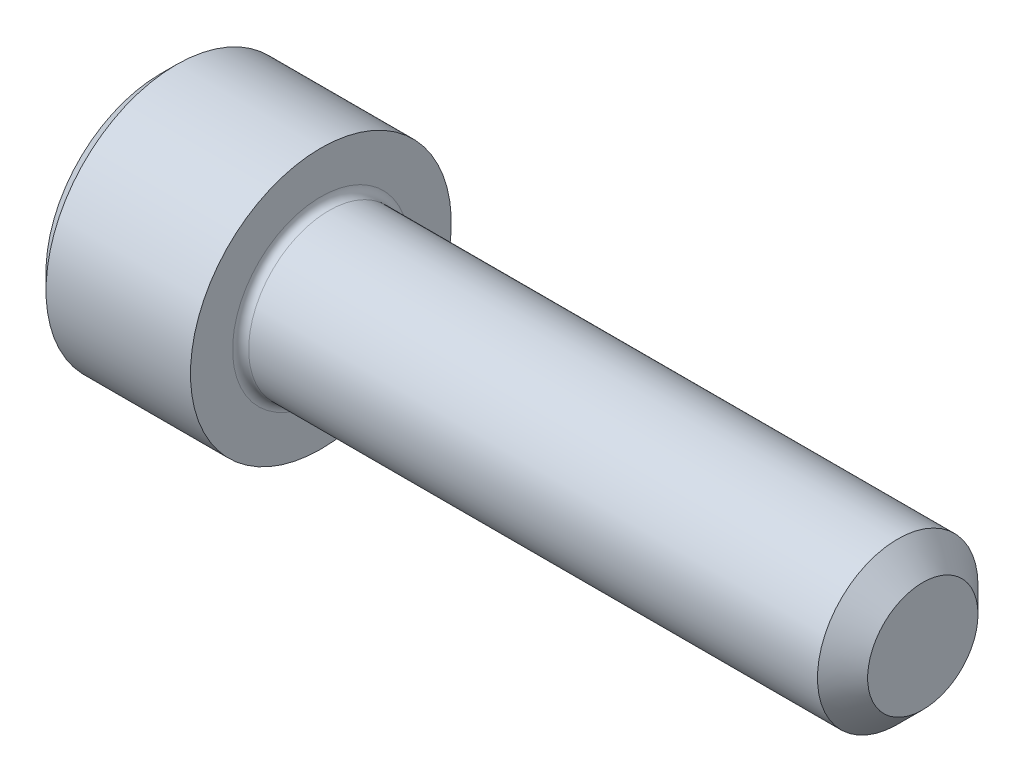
ISO-10303-21;
HEADER;
FILE_DESCRIPTION(('STEP AP214'),'2;1');
FILE_NAME('part.step','',(''),(''),'','','');
FILE_SCHEMA(('AUTOMOTIVE_DESIGN { 1 0 10303 214 1 1 1 1 }'));
ENDSEC;
DATA;
#1=APPLICATION_CONTEXT('core data for automotive mechanical design processes');
#2=APPLICATION_PROTOCOL_DEFINITION('international standard','automotive_design',2000,#1);
#3=PRODUCT_CONTEXT('',#1,'mechanical');
#4=PRODUCT('Part','Part','',(#3));
#5=PRODUCT_RELATED_PRODUCT_CATEGORY('part','',(#4));
#6=PRODUCT_DEFINITION_FORMATION('','',#4);
#7=PRODUCT_DEFINITION_CONTEXT('part definition',#1,'design');
#8=PRODUCT_DEFINITION('design','',#6,#7);
#9=PRODUCT_DEFINITION_SHAPE('','',#8);
#10=(LENGTH_UNIT() NAMED_UNIT(*) SI_UNIT(.MILLI.,.METRE.));
#11=(NAMED_UNIT(*) PLANE_ANGLE_UNIT() SI_UNIT($,.RADIAN.));
#12=(NAMED_UNIT(*) SI_UNIT($,.STERADIAN.) SOLID_ANGLE_UNIT());
#13=UNCERTAINTY_MEASURE_WITH_UNIT(LENGTH_MEASURE(1.E-05),#10,'distance_accuracy_value','');
#14=(GEOMETRIC_REPRESENTATION_CONTEXT(3) GLOBAL_UNCERTAINTY_ASSIGNED_CONTEXT((#13)) GLOBAL_UNIT_ASSIGNED_CONTEXT((#10,
#11,#12)) REPRESENTATION_CONTEXT('',''));
#15=CARTESIAN_POINT('',(0.,0.,0.));
#16=DIRECTION('',(0.,0.,1.));
#17=DIRECTION('',(1.,0.,0.));
#18=AXIS2_PLACEMENT_3D('',#15,#16,#17);
#19=CARTESIAN_POINT('',(27.655035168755,0.837738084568,-0.498957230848));
#20=DIRECTION('',(-1.,0.,0.));
#21=DIRECTION('',(0.,0.,-1.));
#22=AXIS2_PLACEMENT_3D('',#19,#20,#21);
#23=CONICAL_SURFACE('',#22,3.375,0.785398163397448);
#24=CARTESIAN_POINT('',(28.280035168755,0.837738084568,-0.498957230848));
#25=DIRECTION('',(-1.,0.,0.));
#26=DIRECTION('',(0.,0.,-1.));
#27=AXIS2_PLACEMENT_3D('',#24,#25,#26);
#28=CIRCLE('',#27,2.75);
#29=CARTESIAN_POINT('',(28.280035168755,0.837738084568,-3.248957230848));
#30=VERTEX_POINT('',#29);
#31=EDGE_CURVE('E10',#30,#30,#28,.T.);
#32=ORIENTED_EDGE('',*,*,#31,.T.);
#33=EDGE_LOOP('',(#32));
#34=FACE_BOUND('',#33,.T.);
#35=CARTESIAN_POINT('',(27.030035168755,0.837738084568,-0.498957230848));
#36=DIRECTION('',(-1.,0.,0.));
#37=DIRECTION('',(0.,0.,-1.));
#38=AXIS2_PLACEMENT_3D('',#35,#36,#37);
#39=CIRCLE('',#38,4.);
#40=CARTESIAN_POINT('',(27.030035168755,0.837738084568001,-4.498957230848));
#41=VERTEX_POINT('',#40);
#42=EDGE_CURVE('E25',#41,#41,#39,.T.);
#43=ORIENTED_EDGE('',*,*,#42,.F.);
#44=EDGE_LOOP('',(#43));
#45=FACE_BOUND('',#44,.T.);
#46=ADVANCED_FACE('F16',(#34,#45),#23,.T.);
#47=CARTESIAN_POINT('',(28.280035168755,0.837738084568,-0.498957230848));
#48=DIRECTION('',(-1.,0.,0.));
#49=DIRECTION('',(0.,0.,1.));
#50=AXIS2_PLACEMENT_3D('',#47,#48,#49);
#51=PLANE('',#50);
#52=ORIENTED_EDGE('',*,*,#31,.F.);
#53=EDGE_LOOP('',(#52));
#54=FACE_BOUND('',#53,.T.);
#55=ADVANCED_FACE('F428',(#54),#51,.F.);
#56=CARTESIAN_POINT('',(28.280035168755,0.837738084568,-0.498957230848));
#57=DIRECTION('',(-1.,0.,0.));
#58=DIRECTION('',(0.,0.,-1.));
#59=AXIS2_PLACEMENT_3D('',#56,#57,#58);
#60=CYLINDRICAL_SURFACE('',#59,4.);
#61=ORIENTED_EDGE('',*,*,#42,.T.);
#62=EDGE_LOOP('',(#61));
#63=FACE_BOUND('',#62,.T.);
#64=CARTESIAN_POINT('',(-1.319964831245,0.837738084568,-0.498957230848));
#65=DIRECTION('',(-1.,0.,0.));
#66=DIRECTION('',(0.,0.,-1.));
#67=AXIS2_PLACEMENT_3D('',#64,#65,#66);
#68=CIRCLE('',#67,4.);
#69=CARTESIAN_POINT('',(-1.319964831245,0.837738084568,-4.498957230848));
#70=VERTEX_POINT('',#69);
#71=EDGE_CURVE('E230',#70,#70,#68,.T.);
#72=ORIENTED_EDGE('',*,*,#71,.F.);
#73=EDGE_LOOP('',(#72));
#74=FACE_BOUND('',#73,.T.);
#75=ADVANCED_FACE('F432',(#63,#74),#60,.T.);
#76=CARTESIAN_POINT('',(-1.319964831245,0.837738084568,-0.498957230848));
#77=DIRECTION('',(-1.,0.,0.));
#78=DIRECTION('',(0.,0.,-1.));
#79=AXIS2_PLACEMENT_3D('',#76,#77,#78);
#80=TOROIDAL_SURFACE('',#79,4.4,0.4);
#81=ORIENTED_EDGE('',*,*,#71,.T.);
#82=EDGE_LOOP('',(#81));
#83=FACE_BOUND('',#82,.T.);
#84=CARTESIAN_POINT('',(-1.719964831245,0.837738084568,-0.498957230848));
#85=DIRECTION('',(-1.,0.,0.));
#86=DIRECTION('',(0.,0.,-1.));
#87=AXIS2_PLACEMENT_3D('',#84,#85,#86);
#88=CIRCLE('',#87,4.4);
#89=CARTESIAN_POINT('',(-1.719964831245,0.837738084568,-4.898957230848));
#90=VERTEX_POINT('',#89);
#91=EDGE_CURVE('E209',#90,#90,#88,.T.);
#92=ORIENTED_EDGE('',*,*,#91,.F.);
#93=EDGE_LOOP('',(#92));
#94=FACE_BOUND('',#93,.T.);
#95=ADVANCED_FACE('F440',(#83,#94),#80,.F.);
#96=CARTESIAN_POINT('',(-3.85393942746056,0.837738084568,-0.498957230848));
#97=DIRECTION('',(-1.,0.,0.));
#98=DIRECTION('',(0.,-1.,0.));
#99=AXIS2_PLACEMENT_3D('',#96,#97,#98);
#100=CONICAL_SURFACE('',#99,1.5,1.0471975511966);
#101=CARTESIAN_POINT('',(-2.98791402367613,0.837738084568,-0.498957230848));
#102=VERTEX_POINT('',#101);
#103=VERTEX_LOOP('',#102);
#104=FACE_BOUND('',#103,.T.);
#105=CARTESIAN_POINT('',(-4.719964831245,0.837738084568,-0.498957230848));
#106=DIRECTION('',(1.,0.,0.));
#107=DIRECTION('',(0.,1.,0.));
#108=AXIS2_PLACEMENT_3D('',#105,#106,#107);
#109=CIRCLE('',#108,3.);
#110=CARTESIAN_POINT('',(-4.719964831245,3.837738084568,-0.498957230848));
#111=VERTEX_POINT('',#110);
#112=EDGE_CURVE('E206',#111,#111,#109,.T.);
#113=ORIENTED_EDGE('',*,*,#112,.F.);
#114=EDGE_LOOP('',(#113));
#115=FACE_BOUND('',#114,.T.);
#116=ADVANCED_FACE('F446',(#104,#115),#100,.F.);
#117=CARTESIAN_POINT('',(-1.719964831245,0.837738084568,-0.498957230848));
#118=DIRECTION('',(1.,0.,0.));
#119=DIRECTION('',(0.,1.,0.));
#120=AXIS2_PLACEMENT_3D('',#117,#118,#119);
#121=PLANE('',#120);
#122=ORIENTED_EDGE('',*,*,#91,.T.);
#123=EDGE_LOOP('',(#122));
#124=FACE_BOUND('',#123,.T.);
#125=CARTESIAN_POINT('',(-1.719964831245,0.837738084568,-0.498957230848));
#126=DIRECTION('',(1.,0.,0.));
#127=DIRECTION('',(0.,1.,0.));
#128=AXIS2_PLACEMENT_3D('',#125,#126,#127);
#129=CIRCLE('',#128,6.5);
#130=CARTESIAN_POINT('',(-1.719964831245,7.337738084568,-0.498957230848));
#131=VERTEX_POINT('',#130);
#132=EDGE_CURVE('E210',#131,#131,#129,.T.);
#133=ORIENTED_EDGE('',*,*,#132,.T.);
#134=EDGE_LOOP('',(#133));
#135=FACE_BOUND('',#134,.T.);
#136=ADVANCED_FACE('F450',(#124,#135),#121,.T.);
#137=CARTESIAN_POINT('',(-9.719964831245,0.837738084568,-0.498957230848));
#138=DIRECTION('',(1.,0.,0.));
#139=DIRECTION('',(0.,1.,0.));
#140=AXIS2_PLACEMENT_3D('',#137,#138,#139);
#141=CYLINDRICAL_SURFACE('',#140,3.);
#142=CARTESIAN_POINT('',(-5.719964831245,0.837738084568,-0.498957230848));
#143=DIRECTION('',(1.,0.,0.));
#144=DIRECTION('',(0.,0.866025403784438,-0.5));
#145=AXIS2_PLACEMENT_3D('',#142,#143,#144);
#146=CIRCLE('',#145,3.);
#147=CARTESIAN_POINT('',(-5.719964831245,3.43581429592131,-1.998957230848));
#148=VERTEX_POINT('',#147);
#149=CARTESIAN_POINT('',(-5.719964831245,3.837738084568,-0.498957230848));
#150=VERTEX_POINT('',#149);
#151=EDGE_CURVE('E247',#148,#150,#146,.T.);
#152=ORIENTED_EDGE('',*,*,#151,.F.);
#153=CARTESIAN_POINT('',(-5.719964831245,0.837738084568,-0.498957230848));
#154=DIRECTION('',(1.,0.,0.));
#155=DIRECTION('',(0.,0.,-1.));
#156=AXIS2_PLACEMENT_3D('',#153,#154,#155);
#157=CIRCLE('',#156,3.);
#158=CARTESIAN_POINT('',(-5.719964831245,0.837738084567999,-3.498957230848));
#159=VERTEX_POINT('',#158);
#160=EDGE_CURVE('E159',#159,#148,#157,.T.);
#161=ORIENTED_EDGE('',*,*,#160,.F.);
#162=CARTESIAN_POINT('',(-5.719964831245,0.837738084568,-0.498957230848));
#163=DIRECTION('',(1.,0.,0.));
#164=DIRECTION('',(0.,-0.866025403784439,-0.5));
#165=AXIS2_PLACEMENT_3D('',#162,#163,#164);
#166=CIRCLE('',#165,3.);
#167=CARTESIAN_POINT('',(-5.719964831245,-1.76033812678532,-1.998957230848));
#168=VERTEX_POINT('',#167);
#169=EDGE_CURVE('E154',#168,#159,#166,.T.);
#170=ORIENTED_EDGE('',*,*,#169,.F.);
#171=CARTESIAN_POINT('',(-5.719964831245,0.837738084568,-0.498957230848));
#172=DIRECTION('',(1.,0.,0.));
#173=DIRECTION('',(0.,-0.866025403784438,0.5));
#174=AXIS2_PLACEMENT_3D('',#171,#172,#173);
#175=CIRCLE('',#174,3.);
#176=CARTESIAN_POINT('',(-5.719964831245,-1.76033812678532,1.001042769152));
#177=VERTEX_POINT('',#176);
#178=EDGE_CURVE('E146',#177,#168,#175,.T.);
#179=ORIENTED_EDGE('',*,*,#178,.F.);
#180=CARTESIAN_POINT('',(-5.719964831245,0.837738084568,-0.498957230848));
#181=DIRECTION('',(1.,0.,0.));
#182=DIRECTION('',(0.,0.,1.));
#183=AXIS2_PLACEMENT_3D('',#180,#181,#182);
#184=CIRCLE('',#183,3.);
#185=CARTESIAN_POINT('',(-5.719964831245,0.837738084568,2.501042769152));
#186=VERTEX_POINT('',#185);
#187=EDGE_CURVE('E135',#186,#177,#184,.T.);
#188=ORIENTED_EDGE('',*,*,#187,.F.);
#189=CARTESIAN_POINT('',(-5.719964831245,0.837738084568,-0.498957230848));
#190=DIRECTION('',(1.,0.,0.));
#191=DIRECTION('',(0.,0.866025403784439,0.5));
#192=AXIS2_PLACEMENT_3D('',#189,#190,#191);
#193=CIRCLE('',#192,3.);
#194=CARTESIAN_POINT('',(-5.719964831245,3.43581429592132,1.001042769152));
#195=VERTEX_POINT('',#194);
#196=EDGE_CURVE('E145',#195,#186,#193,.T.);
#197=ORIENTED_EDGE('',*,*,#196,.F.);
#198=CARTESIAN_POINT('',(-5.719964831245,0.837738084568,-0.498957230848));
#199=DIRECTION('',(1.,0.,0.));
#200=DIRECTION('',(0.,1.,0.));
#201=AXIS2_PLACEMENT_3D('',#198,#199,#200);
#202=CIRCLE('',#201,3.);
#203=EDGE_CURVE('E118',#150,#195,#202,.T.);
#204=ORIENTED_EDGE('',*,*,#203,.F.);
#205=EDGE_LOOP('',(#152,#161,#170,#179,#188,#197,#204));
#206=FACE_BOUND('',#205,.T.);
#207=ORIENTED_EDGE('',*,*,#112,.T.);
#208=EDGE_LOOP('',(#207));
#209=FACE_BOUND('',#208,.T.);
#210=ADVANCED_FACE('F150',(#206,#209),#141,.F.);
#211=CARTESIAN_POINT('',(-9.719964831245,0.837738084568,-0.498957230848));
#212=DIRECTION('',(1.,0.,0.));
#213=DIRECTION('',(0.,1.,0.));
#214=AXIS2_PLACEMENT_3D('',#211,#212,#213);
#215=CYLINDRICAL_SURFACE('',#214,6.5);
#216=ORIENTED_EDGE('',*,*,#132,.F.);
#217=EDGE_LOOP('',(#216));
#218=FACE_BOUND('',#217,.T.);
#219=CARTESIAN_POINT('',(-8.919964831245,0.837738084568,-0.498957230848));
#220=DIRECTION('',(1.,0.,0.));
#221=DIRECTION('',(0.,1.,0.));
#222=AXIS2_PLACEMENT_3D('',#219,#220,#221);
#223=CIRCLE('',#222,6.5);
#224=CARTESIAN_POINT('',(-8.919964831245,7.337738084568,-0.498957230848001));
#225=VERTEX_POINT('',#224);
#226=EDGE_CURVE('E347',#225,#225,#223,.T.);
#227=ORIENTED_EDGE('',*,*,#226,.T.);
#228=EDGE_LOOP('',(#227));
#229=FACE_BOUND('',#228,.T.);
#230=ADVANCED_FACE('F455',(#218,#229),#215,.T.);
#231=CARTESIAN_POINT('',(-5.719964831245,0.837738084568,-0.498957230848));
#232=DIRECTION('',(-1.,0.,0.));
#233=DIRECTION('',(0.,0.,1.));
#234=AXIS2_PLACEMENT_3D('',#231,#232,#233);
#235=PLANE('',#234);
#236=ORIENTED_EDGE('',*,*,#203,.T.);
#237=DIRECTION('',(0.,0.5,-0.866025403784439));
#238=VECTOR('',#237,1.);
#239=CARTESIAN_POINT('',(-5.719964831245,3.43581429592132,1.001042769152));
#240=LINE('',#239,#238);
#241=CARTESIAN_POINT('',(-5.719964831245,4.30183969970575,-0.498957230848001));
#242=VERTEX_POINT('',#241);
#243=EDGE_CURVE('E108',#195,#242,#240,.T.);
#244=ORIENTED_EDGE('',*,*,#243,.T.);
#245=DIRECTION('',(0.,-0.5,-0.866025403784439));
#246=VECTOR('',#245,1.);
#247=CARTESIAN_POINT('',(-5.719964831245,4.30183969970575,-0.498957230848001));
#248=LINE('',#247,#246);
#249=EDGE_CURVE('E185',#242,#148,#248,.T.);
#250=ORIENTED_EDGE('',*,*,#249,.T.);
#251=ORIENTED_EDGE('',*,*,#151,.T.);
#252=EDGE_LOOP('',(#236,#244,#250,#251));
#253=FACE_BOUND('',#252,.T.);
#254=ADVANCED_FACE('F458',(#253),#235,.T.);
#255=CARTESIAN_POINT('',(-5.719964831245,0.837738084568,-0.498957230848));
#256=DIRECTION('',(-1.,0.,0.));
#257=DIRECTION('',(0.,0.,1.));
#258=AXIS2_PLACEMENT_3D('',#255,#256,#257);
#259=PLANE('',#258);
#260=ORIENTED_EDGE('',*,*,#196,.T.);
#261=DIRECTION('',(0.,1.,0.));
#262=VECTOR('',#261,1.);
#263=CARTESIAN_POINT('',(-5.719964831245,0.837738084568,2.501042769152));
#264=LINE('',#263,#262);
#265=CARTESIAN_POINT('',(-5.719964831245,2.56978889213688,2.501042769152));
#266=VERTEX_POINT('',#265);
#267=EDGE_CURVE('E19',#186,#266,#264,.T.);
#268=ORIENTED_EDGE('',*,*,#267,.T.);
#269=DIRECTION('',(0.,0.5,-0.866025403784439));
#270=VECTOR('',#269,1.);
#271=CARTESIAN_POINT('',(-5.719964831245,2.56978889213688,2.501042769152));
#272=LINE('',#271,#270);
#273=EDGE_CURVE('E192',#266,#195,#272,.T.);
#274=ORIENTED_EDGE('',*,*,#273,.T.);
#275=EDGE_LOOP('',(#260,#268,#274));
#276=FACE_BOUND('',#275,.T.);
#277=ADVANCED_FACE('F465',(#276),#259,.T.);
#278=CARTESIAN_POINT('',(-5.719964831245,0.837738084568,-0.498957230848));
#279=DIRECTION('',(-1.,0.,0.));
#280=DIRECTION('',(0.,0.,1.));
#281=AXIS2_PLACEMENT_3D('',#278,#279,#280);
#282=PLANE('',#281);
#283=ORIENTED_EDGE('',*,*,#187,.T.);
#284=DIRECTION('',(0.,0.5,0.866025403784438));
#285=VECTOR('',#284,1.);
#286=CARTESIAN_POINT('',(-5.719964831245,-1.76033812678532,1.001042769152));
#287=LINE('',#286,#285);
#288=CARTESIAN_POINT('',(-5.719964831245,-0.89431272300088,2.501042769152));
#289=VERTEX_POINT('',#288);
#290=EDGE_CURVE('E139',#177,#289,#287,.T.);
#291=ORIENTED_EDGE('',*,*,#290,.T.);
#292=DIRECTION('',(0.,1.,0.));
#293=VECTOR('',#292,1.);
#294=CARTESIAN_POINT('',(-5.719964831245,-0.89431272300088,2.501042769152));
#295=LINE('',#294,#293);
#296=EDGE_CURVE('E141',#289,#186,#295,.T.);
#297=ORIENTED_EDGE('',*,*,#296,.T.);
#298=EDGE_LOOP('',(#283,#291,#297));
#299=FACE_BOUND('',#298,.T.);
#300=ADVANCED_FACE('F137',(#299),#282,.T.);
#301=CARTESIAN_POINT('',(-5.719964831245,0.837738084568,-0.498957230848));
#302=DIRECTION('',(-1.,0.,0.));
#303=DIRECTION('',(0.,0.,1.));
#304=AXIS2_PLACEMENT_3D('',#301,#302,#303);
#305=PLANE('',#304);
#306=ORIENTED_EDGE('',*,*,#178,.T.);
#307=DIRECTION('',(0.,-0.5,0.866025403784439));
#308=VECTOR('',#307,1.);
#309=CARTESIAN_POINT('',(-5.719964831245,-1.76033812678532,-1.998957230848));
#310=LINE('',#309,#308);
#311=CARTESIAN_POINT('',(-5.719964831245,-2.62636353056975,-0.498957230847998));
#312=VERTEX_POINT('',#311);
#313=EDGE_CURVE('E164',#168,#312,#310,.T.);
#314=ORIENTED_EDGE('',*,*,#313,.T.);
#315=DIRECTION('',(0.,0.5,0.866025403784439));
#316=VECTOR('',#315,1.);
#317=CARTESIAN_POINT('',(-5.719964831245,-2.62636353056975,-0.498957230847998));
#318=LINE('',#317,#316);
#319=EDGE_CURVE('E161',#312,#177,#318,.T.);
#320=ORIENTED_EDGE('',*,*,#319,.T.);
#321=EDGE_LOOP('',(#306,#314,#320));
#322=FACE_BOUND('',#321,.T.);
#323=ADVANCED_FACE('F162',(#322),#305,.T.);
#324=CARTESIAN_POINT('',(-5.719964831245,0.837738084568,-0.498957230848));
#325=DIRECTION('',(-1.,0.,0.));
#326=DIRECTION('',(0.,0.,1.));
#327=AXIS2_PLACEMENT_3D('',#324,#325,#326);
#328=PLANE('',#327);
#329=ORIENTED_EDGE('',*,*,#160,.T.);
#330=DIRECTION('',(0.,-0.5,-0.866025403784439));
#331=VECTOR('',#330,1.);
#332=CARTESIAN_POINT('',(-5.719964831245,3.43581429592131,-1.998957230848));
#333=LINE('',#332,#331);
#334=CARTESIAN_POINT('',(-5.719964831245,2.56978889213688,-3.498957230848));
#335=VERTEX_POINT('',#334);
#336=EDGE_CURVE('E189',#148,#335,#333,.T.);
#337=ORIENTED_EDGE('',*,*,#336,.T.);
#338=DIRECTION('',(0.,-1.,0.));
#339=VECTOR('',#338,1.);
#340=CARTESIAN_POINT('',(-5.719964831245,2.56978889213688,-3.498957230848));
#341=LINE('',#340,#339);
#342=EDGE_CURVE('E200',#335,#159,#341,.T.);
#343=ORIENTED_EDGE('',*,*,#342,.T.);
#344=EDGE_LOOP('',(#329,#337,#343));
#345=FACE_BOUND('',#344,.T.);
#346=ADVANCED_FACE('F374',(#345),#328,.T.);
#347=CARTESIAN_POINT('',(-5.719964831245,0.837738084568,-0.498957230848));
#348=DIRECTION('',(-1.,0.,0.));
#349=DIRECTION('',(0.,0.,1.));
#350=AXIS2_PLACEMENT_3D('',#347,#348,#349);
#351=PLANE('',#350);
#352=ORIENTED_EDGE('',*,*,#169,.T.);
#353=DIRECTION('',(0.,-1.,0.));
#354=VECTOR('',#353,1.);
#355=CARTESIAN_POINT('',(-5.719964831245,0.837738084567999,-3.498957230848));
#356=LINE('',#355,#354);
#357=CARTESIAN_POINT('',(-5.719964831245,-0.89431272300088,-3.498957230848));
#358=VERTEX_POINT('',#357);
#359=EDGE_CURVE('E197',#159,#358,#356,.T.);
#360=ORIENTED_EDGE('',*,*,#359,.T.);
#361=DIRECTION('',(0.,-0.5,0.866025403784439));
#362=VECTOR('',#361,1.);
#363=CARTESIAN_POINT('',(-5.719964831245,-0.89431272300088,-3.498957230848));
#364=LINE('',#363,#362);
#365=EDGE_CURVE('E194',#358,#168,#364,.T.);
#366=ORIENTED_EDGE('',*,*,#365,.T.);
#367=EDGE_LOOP('',(#352,#360,#366));
#368=FACE_BOUND('',#367,.T.);
#369=ADVANCED_FACE('F367',(#368),#351,.T.);
#370=CARTESIAN_POINT('',(-9.319964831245,0.837738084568,-0.498957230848));
#371=DIRECTION('',(1.,0.,0.));
#372=DIRECTION('',(0.,1.,0.));
#373=AXIS2_PLACEMENT_3D('',#370,#371,#372);
#374=CONICAL_SURFACE('',#373,6.1,0.785398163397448);
#375=ORIENTED_EDGE('',*,*,#226,.F.);
#376=EDGE_LOOP('',(#375));
#377=FACE_BOUND('',#376,.T.);
#378=CARTESIAN_POINT('',(-9.719964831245,0.837738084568,-0.498957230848));
#379=DIRECTION('',(1.,0.,0.));
#380=DIRECTION('',(0.,1.,0.));
#381=AXIS2_PLACEMENT_3D('',#378,#379,#380);
#382=CIRCLE('',#381,5.7);
#383=CARTESIAN_POINT('',(-9.719964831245,6.537738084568,-0.498957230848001));
#384=VERTEX_POINT('',#383);
#385=EDGE_CURVE('E227',#384,#384,#382,.T.);
#386=ORIENTED_EDGE('',*,*,#385,.T.);
#387=EDGE_LOOP('',(#386));
#388=FACE_BOUND('',#387,.T.);
#389=ADVANCED_FACE('F413',(#377,#388),#374,.T.);
#390=CARTESIAN_POINT('',(-9.54675975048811,0.837738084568,-0.498957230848));
#391=DIRECTION('',(-1.,0.,0.));
#392=DIRECTION('',(0.,-1.,0.));
#393=AXIS2_PLACEMENT_3D('',#390,#391,#392);
#394=CONICAL_SURFACE('',#393,3.3,1.0471975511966);
#395=CARTESIAN_POINT('',(-9.6415038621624,2.56978889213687,2.501042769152));
#396=CARTESIAN_POINT('',(-9.63069897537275,2.58850371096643,2.46862775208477));
#397=CARTESIAN_POINT('',(-9.60952593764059,2.62608782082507,2.40353016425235));
#398=CARTESIAN_POINT('',(-9.57925093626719,2.68281288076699,2.30527947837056));
#399=CARTESIAN_POINT('',(-9.55047791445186,2.74008125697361,2.20608774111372));
#400=CARTESIAN_POINT('',(-9.52334084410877,2.79789844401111,2.10594543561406));
#401=CARTESIAN_POINT('',(-9.49446752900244,2.86435225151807,1.99084406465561));
#402=CARTESIAN_POINT('',(-9.46146291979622,2.94891214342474,1.84438203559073));
#403=CARTESIAN_POINT('',(-9.42714649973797,3.05419639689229,1.66202435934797));
#404=CARTESIAN_POINT('',(-9.39972510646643,3.16640877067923,1.46766682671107));
#405=CARTESIAN_POINT('',(-9.38316615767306,3.26873266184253,1.29043664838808));
#406=CARTESIAN_POINT('',(-9.37514574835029,3.356642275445,1.13817273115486));
#407=CARTESIAN_POINT('',(-9.37349658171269,3.4119826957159,1.04232031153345));
#408=CARTESIAN_POINT('',(-9.37362253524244,3.46789185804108,0.94548280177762));
#409=CARTESIAN_POINT('',(-9.37579427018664,3.52646721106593,0.8440273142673));
#410=CARTESIAN_POINT('',(-9.38449199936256,3.61161758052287,0.69654254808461));
#411=CARTESIAN_POINT('',(-9.39872478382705,3.69702751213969,0.54860820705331));
#412=CARTESIAN_POINT('',(-9.41815930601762,3.78167693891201,0.401991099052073));
#413=CARTESIAN_POINT('',(-9.44220589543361,3.86472350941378,0.258150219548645));
#414=CARTESIAN_POINT('',(-9.46990780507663,3.94487859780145,0.119317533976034));
#415=CARTESIAN_POINT('',(-9.50058945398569,4.02215743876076,-0.014533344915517));
#416=CARTESIAN_POINT('',(-9.5333599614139,4.09596715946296,-0.142375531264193));
#417=CARTESIAN_POINT('',(-9.56791525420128,4.16696974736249,-0.265355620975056));
#418=CARTESIAN_POINT('',(-9.60376563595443,4.23520402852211,-0.383540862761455));
#419=CARTESIAN_POINT('',(-9.62881661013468,4.27986442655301,-0.460894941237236));
#420=CARTESIAN_POINT('',(-9.6415038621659,4.30183969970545,-0.498957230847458));
#421=(BOUNDED_CURVE() B_SPLINE_CURVE(3,(#395,#396,#397,#398,#399,#400,#401,#402,#403,#404,#405,
#406,#407,#408,#409,#410,#411,#412,#413,#414,#415,#416,#417,#418,#419,#420),.UNSPECIFIED.,.F.,
.F.) B_SPLINE_CURVE_WITH_KNOTS((4,1,1,1,1,1,1,1,1,1,1,1,1,1,1,1,1,1,1,1,1,1,1,4),(0.,
0.0332537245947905,0.0666371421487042,0.100156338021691,0.133965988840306,0.167926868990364,
0.216153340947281,0.280939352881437,0.349904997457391,0.408941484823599,0.45602939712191,
0.500003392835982,0.503331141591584,0.551385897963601,0.599907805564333,0.648728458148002,
0.697562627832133,0.745283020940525,0.79189836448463,0.83631958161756,0.879648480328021,
0.920821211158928,0.960934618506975,1.),
.UNSPECIFIED.) CURVE() GEOMETRIC_REPRESENTATION_ITEM() RATIONAL_B_SPLINE_CURVE((1.,1.,1.,1.,1.,
1.,1.,1.,1.,1.,1.,1.,1.,1.,1.,1.,1.,1.,1.,1.,1.,1.,1.,1.,1.,1.)) REPRESENTATION_ITEM(''));
#422=CARTESIAN_POINT('',(-9.64150386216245,2.56978889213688,2.501042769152));
#423=VERTEX_POINT('',#422);
#424=CARTESIAN_POINT('',(-9.64150386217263,4.30183969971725,-0.498957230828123));
#425=VERTEX_POINT('',#424);
#426=EDGE_CURVE('E193',#423,#425,#421,.T.);
#427=ORIENTED_EDGE('',*,*,#426,.F.);
#428=CARTESIAN_POINT('',(-9.64150386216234,-0.89431272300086,2.501042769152));
#429=CARTESIAN_POINT('',(-9.63069894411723,-0.8568830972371,2.501042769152));
#430=CARTESIAN_POINT('',(-9.61120002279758,-0.78765816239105,2.501042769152));
#431=CARTESIAN_POINT('',(-9.59097571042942,-0.71220116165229,2.501042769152));
#432=CARTESIAN_POINT('',(-9.57121877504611,-0.63629117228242,2.501042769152));
#433=CARTESIAN_POINT('',(-9.55047807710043,-0.5537286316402,2.501042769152));
#434=CARTESIAN_POINT('',(-9.52334105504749,-0.43809455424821,2.501042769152));
#435=CARTESIAN_POINT('',(-9.49863860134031,-0.32438601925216,2.501042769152));
#436=CARTESIAN_POINT('',(-9.47977443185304,-0.22989675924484,2.501042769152));
#437=CARTESIAN_POINT('',(-9.4555287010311,-0.099653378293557,2.501042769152));
#438=CARTESIAN_POINT('',(-9.43237766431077,0.042407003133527,2.50104276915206));
#439=CARTESIAN_POINT('',(-9.4120663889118,0.197912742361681,2.50104276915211));
#440=CARTESIAN_POINT('',(-9.39582672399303,0.34711419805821,2.50104276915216));
#441=CARTESIAN_POINT('',(-9.38659212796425,0.461234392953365,2.5010427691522));
#442=CARTESIAN_POINT('',(-9.37943108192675,0.585451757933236,2.50104276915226));
#443=CARTESIAN_POINT('',(-9.37495599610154,0.692132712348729,2.50104276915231));
#444=CARTESIAN_POINT('',(-9.37349659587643,0.790072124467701,2.50104276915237));
#445=CARTESIAN_POINT('',(-9.37361193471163,0.892494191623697,2.50104276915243));
#446=CARTESIAN_POINT('',(-9.37456500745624,0.952745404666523,2.50104276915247));
#447=CARTESIAN_POINT('',(-9.37818957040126,1.06593989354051,2.50104276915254));
#448=CARTESIAN_POINT('',(-9.38449162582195,1.1893406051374,2.50104276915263));
#449=CARTESIAN_POINT('',(-9.39635358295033,1.33170509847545,2.50104276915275));
#450=CARTESIAN_POINT('',(-9.40852392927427,1.4455285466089,2.50104276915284));
#451=CARTESIAN_POINT('',(-9.42227115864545,1.55786374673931,2.50104276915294));
#452=CARTESIAN_POINT('',(-9.43911822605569,1.67422957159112,2.50104276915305));
#453=CARTESIAN_POINT('',(-9.45736920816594,1.78330669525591,2.50104276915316));
#454=CARTESIAN_POINT('',(-9.47635456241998,1.88834163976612,2.50104276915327));
#455=CARTESIAN_POINT('',(-9.50058892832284,2.01042198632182,2.5010427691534));
#456=CARTESIAN_POINT('',(-9.52815249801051,2.13458608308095,2.50104276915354));
#457=CARTESIAN_POINT('',(-9.55111113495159,2.23099240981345,2.50104276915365));
#458=CARTESIAN_POINT('',(-9.57407740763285,2.32350591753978,2.50104276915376));
#459=CARTESIAN_POINT('',(-9.60147773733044,2.42780815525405,2.50104276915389));
#460=CARTESIAN_POINT('',(-9.62638650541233,2.51717418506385,2.501042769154));
#461=CARTESIAN_POINT('',(-9.63900954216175,2.56114830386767,2.50104276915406));
#462=CARTESIAN_POINT('',(-9.64150386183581,2.56978889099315,2.50104276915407));
#463=(BOUNDED_CURVE() B_SPLINE_CURVE(3,(#428,#429,#430,#431,#432,#433,#434,#435,#436,#437,#438,
#439,#440,#441,#442,#443,#444,#445,#446,#447,#448,#449,#450,#451,#452,#453,#454,#455,#456,#457,
#458,#459,#460,#461,#462),.UNSPECIFIED.,.F.,.F.) B_SPLINE_CURVE_WITH_KNOTS((4,1,1,1,1,1,1,1,1,1,
1,1,1,1,1,1,1,1,1,1,1,1,1,1,1,1,1,1,1,1,1,1,4),(0.,0.0332536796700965,0.0613683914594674,
0.0666370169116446,0.100156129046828,0.133965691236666,0.167926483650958,0.199396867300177,
0.216152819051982,0.28093863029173,0.322168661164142,0.349904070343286,0.408940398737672,
0.419806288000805,0.456028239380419,0.500003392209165,0.503329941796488,0.543371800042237,
0.5513846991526,0.599906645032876,0.648727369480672,0.673211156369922,0.697561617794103,
0.745282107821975,0.773516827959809,0.791897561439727,0.836318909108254,0.87964794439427,
0.90033577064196,0.920820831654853,0.96093440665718,0.992319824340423,1.),
.UNSPECIFIED.) CURVE() GEOMETRIC_REPRESENTATION_ITEM() RATIONAL_B_SPLINE_CURVE((1.,1.,1.,1.,1.,
1.,1.,1.,1.,1.,1.,1.,1.,1.,1.,1.,1.,1.,1.,1.,1.,1.,1.,1.,1.,1.,1.,1.,1.,1.,1.,1.,1.,1.,1.)) REPRESENTATION_ITEM(''));
#464=CARTESIAN_POINT('',(-9.64150386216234,-0.89431272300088,2.501042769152));
#465=VERTEX_POINT('',#464);
#466=EDGE_CURVE('E169',#465,#423,#463,.T.);
#467=ORIENTED_EDGE('',*,*,#466,.F.);
#468=CARTESIAN_POINT('',(-9.64150386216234,-2.62636353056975,-0.498957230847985));
#469=CARTESIAN_POINT('',(-9.63069898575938,-2.60764872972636,-0.466542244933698));
#470=CARTESIAN_POINT('',(-9.60952598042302,-2.57006467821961,-0.401444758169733));
#471=CARTESIAN_POINT('',(-9.57925103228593,-2.51333972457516,-0.303194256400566));
#472=CARTESIAN_POINT('',(-9.55047807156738,-2.4560714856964,-0.204002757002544));
#473=CARTESIAN_POINT('',(-9.52334105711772,-2.39825444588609,-0.103860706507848));
#474=CARTESIAN_POINT('',(-9.49446779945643,-2.33180082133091,0.011240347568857));
#475=CARTESIAN_POINT('',(-9.46146324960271,-2.24724118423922,0.157701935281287));
#476=CARTESIAN_POINT('',(-9.4271468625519,-2.14195726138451,0.340059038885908));
#477=CARTESIAN_POINT('',(-9.39972543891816,-2.02974523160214,0.53441597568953));
#478=CARTESIAN_POINT('',(-9.38316639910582,-1.92742160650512,0.71164569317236));
#479=CARTESIAN_POINT('',(-9.37514580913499,-1.8395114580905,0.86391053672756));
#480=CARTESIAN_POINT('',(-9.37349660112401,-1.78417110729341,0.95976283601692));
#481=CARTESIAN_POINT('',(-9.37362250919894,-1.72826197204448,1.05660029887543));
#482=CARTESIAN_POINT('',(-9.37579412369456,-1.6696873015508,1.15805460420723));
#483=CARTESIAN_POINT('',(-9.38449172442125,-1.58453686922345,1.30553947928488));
#484=CARTESIAN_POINT('',(-9.39872440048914,-1.49912682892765,1.45347400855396));
#485=CARTESIAN_POINT('',(-9.41815884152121,-1.41447725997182,1.60009136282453));
#486=CARTESIAN_POINT('',(-9.44220537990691,-1.33143052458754,1.74393252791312));
#487=CARTESIAN_POINT('',(-9.46990727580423,-1.25127523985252,1.88276555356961));
#488=CARTESIAN_POINT('',(-9.50058894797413,-1.1739961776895,2.01661681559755));
#489=CARTESIAN_POINT('',(-9.53335951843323,-1.10018620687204,2.14445943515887));
#490=CARTESIAN_POINT('',(-9.56791491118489,-1.02918334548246,2.26743999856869));
#491=CARTESIAN_POINT('',(-9.60376544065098,-0.96094874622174,2.38562579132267));
#492=CARTESIAN_POINT('',(-9.62881653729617,-0.91628812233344,2.46298026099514));
#493=CARTESIAN_POINT('',(-9.64150386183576,-0.89431272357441,2.50104276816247));
#494=(BOUNDED_CURVE() B_SPLINE_CURVE(3,(#468,#469,#470,#471,#472,#473,#474,#475,#476,#477,#478,
#479,#480,#481,#482,#483,#484,#485,#486,#487,#488,#489,#490,#491,#492,#493),.UNSPECIFIED.,.F.,
.F.) B_SPLINE_CURVE_WITH_KNOTS((4,1,1,1,1,1,1,1,1,1,1,1,1,1,1,1,1,1,1,1,1,1,1,4),(0.,
0.0332536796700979,0.0666370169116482,0.100156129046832,0.133965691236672,0.167926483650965,
0.21615281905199,0.280938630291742,0.349904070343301,0.40894039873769,0.456028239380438,
0.500003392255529,0.503329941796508,0.551384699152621,0.599906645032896,0.648727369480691,
0.697561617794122,0.745282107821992,0.791897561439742,0.836318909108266,0.87964794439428,
0.920820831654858,0.960934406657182,1.),
.UNSPECIFIED.) CURVE() GEOMETRIC_REPRESENTATION_ITEM() RATIONAL_B_SPLINE_CURVE((1.,1.,1.,1.,1.,
1.,1.,1.,1.,1.,1.,1.,1.,1.,1.,1.,1.,1.,1.,1.,1.,1.,1.,1.,1.,1.)) REPRESENTATION_ITEM(''));
#495=CARTESIAN_POINT('',(-9.64150386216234,-2.62636353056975,-0.498957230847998));
#496=VERTEX_POINT('',#495);
#497=EDGE_CURVE('E180',#496,#465,#494,.T.);
#498=ORIENTED_EDGE('',*,*,#497,.F.);
#499=CARTESIAN_POINT('',(-9.64150386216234,-0.89431272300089,-3.498957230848));
#500=CARTESIAN_POINT('',(-9.63069898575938,-0.91302752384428,-3.4665422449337));
#501=CARTESIAN_POINT('',(-9.60952598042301,-0.95061157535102,-3.40144475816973));
#502=CARTESIAN_POINT('',(-9.57925103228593,-1.00733652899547,-3.30319425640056));
#503=CARTESIAN_POINT('',(-9.55047807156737,-1.06460476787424,-3.20400275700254));
#504=CARTESIAN_POINT('',(-9.52334105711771,-1.12242180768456,-3.10386070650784));
#505=CARTESIAN_POINT('',(-9.49446779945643,-1.18887543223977,-2.98875965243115));
#506=CARTESIAN_POINT('',(-9.4614632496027,-1.27343506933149,-2.84229806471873));
#507=CARTESIAN_POINT('',(-9.42714686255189,-1.37871899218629,-2.65994096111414));
#508=CARTESIAN_POINT('',(-9.39972543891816,-1.49093102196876,-2.46558402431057));
#509=CARTESIAN_POINT('',(-9.38316639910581,-1.59325464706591,-2.2883543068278));
#510=CARTESIAN_POINT('',(-9.37514580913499,-1.68116479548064,-2.1360894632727));
#511=CARTESIAN_POINT('',(-9.37349660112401,-1.73650514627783,-2.04023716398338));
#512=CARTESIAN_POINT('',(-9.37362250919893,-1.79241428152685,-1.94339970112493));
#513=CARTESIAN_POINT('',(-9.37579412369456,-1.85098895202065,-1.84194539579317));
#514=CARTESIAN_POINT('',(-9.38449172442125,-1.93613938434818,-1.69446052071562));
#515=CARTESIAN_POINT('',(-9.39872440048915,-2.02154942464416,-1.54652599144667));
#516=CARTESIAN_POINT('',(-9.41815884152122,-2.1061989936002,-1.39990863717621));
#517=CARTESIAN_POINT('',(-9.44220537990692,-2.1892457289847,-1.25606747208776));
#518=CARTESIAN_POINT('',(-9.46990727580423,-2.26940101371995,-1.1172344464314));
#519=CARTESIAN_POINT('',(-9.50058894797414,-2.3466800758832,-0.983383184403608));
#520=CARTESIAN_POINT('',(-9.53335951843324,-2.42049004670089,-0.85554056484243));
#521=CARTESIAN_POINT('',(-9.56791491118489,-2.4914929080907,-0.732560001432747));
#522=CARTESIAN_POINT('',(-9.60376544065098,-2.55972750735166,-0.614374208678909));
#523=CARTESIAN_POINT('',(-9.62881653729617,-2.60438813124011,-0.537019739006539));
#524=CARTESIAN_POINT('',(-9.64150386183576,-2.62636352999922,-0.498957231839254));
#525=(BOUNDED_CURVE() B_SPLINE_CURVE(3,(#499,#500,#501,#502,#503,#504,#505,#506,#507,#508,#509,
#510,#511,#512,#513,#514,#515,#516,#517,#518,#519,#520,#521,#522,#523,#524),.UNSPECIFIED.,.F.,
.F.) B_SPLINE_CURVE_WITH_KNOTS((4,1,1,1,1,1,1,1,1,1,1,1,1,1,1,1,1,1,1,1,1,1,1,4),(0.,
0.033253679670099,0.0666370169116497,0.100156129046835,0.133965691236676,0.16792648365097,
0.216152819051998,0.280938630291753,0.349904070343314,0.408940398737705,0.456028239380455,
0.500003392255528,0.503329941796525,0.551384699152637,0.599906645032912,0.648727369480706,
0.697561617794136,0.745282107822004,0.791897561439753,0.836318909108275,0.879647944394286,
0.920820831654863,0.960934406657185,1.),
.UNSPECIFIED.) CURVE() GEOMETRIC_REPRESENTATION_ITEM() RATIONAL_B_SPLINE_CURVE((1.,1.,1.,1.,1.,
1.,1.,1.,1.,1.,1.,1.,1.,1.,1.,1.,1.,1.,1.,1.,1.,1.,1.,1.,1.,1.)) REPRESENTATION_ITEM(''));
#526=CARTESIAN_POINT('',(-9.64150386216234,-0.89431272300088,-3.498957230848));
#527=VERTEX_POINT('',#526);
#528=EDGE_CURVE('E217',#527,#496,#525,.T.);
#529=ORIENTED_EDGE('',*,*,#528,.F.);
#530=CARTESIAN_POINT('',(-9.64150386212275,2.56978889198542,-3.49895723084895));
#531=CARTESIAN_POINT('',(-9.63069894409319,2.53235926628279,-3.4989572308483));
#532=CARTESIAN_POINT('',(-9.61120002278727,2.46313433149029,-3.49895723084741));
#533=CARTESIAN_POINT('',(-9.59097571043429,2.38767733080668,-3.49895723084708));
#534=CARTESIAN_POINT('',(-9.57121877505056,2.31176734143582,-3.49895723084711));
#535=CARTESIAN_POINT('',(-9.55047807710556,2.22920480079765,-3.49895723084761));
#536=CARTESIAN_POINT('',(-9.52334105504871,2.11357072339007,-3.49895723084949));
#537=CARTESIAN_POINT('',(-9.49863860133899,1.99986218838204,-3.49895723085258));
#538=CARTESIAN_POINT('',(-9.47977443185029,1.90537292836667,-3.49895723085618));
#539=CARTESIAN_POINT('',(-9.45552870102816,1.77512954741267,-3.49895723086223));
#540=CARTESIAN_POINT('',(-9.43237766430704,1.63306916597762,-3.49895723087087));
#541=CARTESIAN_POINT('',(-9.41206638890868,1.47756342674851,-3.49895723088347));
#542=CARTESIAN_POINT('',(-9.39582672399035,1.32836197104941,-3.49895723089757));
#543=CARTESIAN_POINT('',(-9.38659212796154,1.21424177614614,-3.49895723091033));
#544=CARTESIAN_POINT('',(-9.37943108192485,1.09002441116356,-3.49895723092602));
#545=CARTESIAN_POINT('',(-9.37495599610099,0.983343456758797,-3.49895723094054));
#546=CARTESIAN_POINT('',(-9.37349659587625,0.885404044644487,-3.49895723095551));
#547=CARTESIAN_POINT('',(-9.37361193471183,0.782981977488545,-3.49895723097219));
#548=CARTESIAN_POINT('',(-9.37456500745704,0.722730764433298,-3.49895723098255));
#549=CARTESIAN_POINT('',(-9.37818957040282,0.609536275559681,-3.49895723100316));
#550=CARTESIAN_POINT('',(-9.38449162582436,0.486135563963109,-3.49895723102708));
#551=CARTESIAN_POINT('',(-9.39635358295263,0.343771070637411,-3.49895723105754));
#552=CARTESIAN_POINT('',(-9.40852392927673,0.229947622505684,-3.49895723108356));
#553=CARTESIAN_POINT('',(-9.422271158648,0.117612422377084,-3.49895723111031));
#554=CARTESIAN_POINT('',(-9.43911822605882,0.00124659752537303,-3.49895723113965));
#555=CARTESIAN_POINT('',(-9.45736920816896,-0.107830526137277,-3.49895723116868));
#556=CARTESIAN_POINT('',(-9.47635456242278,-0.21286547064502,-3.49895723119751));
#557=CARTESIAN_POINT('',(-9.5005889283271,-0.33494581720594,-3.49895723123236));
#558=CARTESIAN_POINT('',(-9.52815249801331,-0.45910991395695,-3.49895723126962));
#559=CARTESIAN_POINT('',(-9.55111113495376,-0.55551624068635,-3.49895723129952));
#560=CARTESIAN_POINT('',(-9.57407740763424,-0.64802974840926,-3.49895723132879));
#561=CARTESIAN_POINT('',(-9.60147773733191,-0.7523319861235,-3.49895723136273));
#562=CARTESIAN_POINT('',(-9.62638650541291,-0.84169801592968,-3.4989572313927));
#563=CARTESIAN_POINT('',(-9.63900954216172,-0.88567213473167,-3.49895723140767));
#564=CARTESIAN_POINT('',(-9.64150386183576,-0.89431272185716,-3.49895723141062));
#565=(BOUNDED_CURVE() B_SPLINE_CURVE(3,(#530,#531,#532,#533,#534,#535,#536,#537,#538,#539,#540,
#541,#542,#543,#544,#545,#546,#547,#548,#549,#550,#551,#552,#553,#554,#555,#556,#557,#558,#559,
#560,#561,#562,#563,#564),.UNSPECIFIED.,.F.,.F.) B_SPLINE_CURVE_WITH_KNOTS((4,1,1,1,1,1,1,1,1,1,
1,1,1,1,1,1,1,1,1,1,1,1,1,1,1,1,1,1,1,1,1,1,4),(0.,0.0332536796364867,0.0613683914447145,
0.0666370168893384,0.100156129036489,0.133965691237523,0.167926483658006,0.199396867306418,
0.216152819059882,0.280938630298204,0.322168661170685,0.349904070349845,0.408940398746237,
0.419806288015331,0.456028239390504,0.500003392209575,0.503329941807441,0.543371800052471,
0.551384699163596,0.599906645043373,0.648727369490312,0.673211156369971,0.697561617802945,
0.74528210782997,0.773516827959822,0.791897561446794,0.836318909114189,0.879647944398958,
0.900335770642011,0.920820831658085,0.96093440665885,0.99231982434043,1.),
.UNSPECIFIED.) CURVE() GEOMETRIC_REPRESENTATION_ITEM() RATIONAL_B_SPLINE_CURVE((1.,1.,1.,1.,1.,
1.,1.,1.,1.,1.,1.,1.,1.,1.,1.,1.,1.,1.,1.,1.,1.,1.,1.,1.,1.,1.,1.,1.,1.,1.,1.,1.,1.,1.,1.)) REPRESENTATION_ITEM(''));
#566=CARTESIAN_POINT('',(-9.64150386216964,2.56978889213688,-3.498957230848));
#567=VERTEX_POINT('',#566);
#568=EDGE_CURVE('E226',#567,#527,#565,.T.);
#569=ORIENTED_EDGE('',*,*,#568,.F.);
#570=CARTESIAN_POINT('',(-9.64150386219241,4.3018396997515,-0.498957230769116));
#571=CARTESIAN_POINT('',(-9.63069897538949,4.28312488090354,-0.531372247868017));
#572=CARTESIAN_POINT('',(-9.60952593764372,4.24554077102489,-0.596469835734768));
#573=CARTESIAN_POINT('',(-9.57925093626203,4.18881571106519,-0.694720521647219));
#574=CARTESIAN_POINT('',(-9.55047791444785,4.13154733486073,-0.79391225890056));
#575=CARTESIAN_POINT('',(-9.5233408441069,4.07373014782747,-0.894054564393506));
#576=CARTESIAN_POINT('',(-9.49446752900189,4.00727634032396,-1.00915593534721));
#577=CARTESIAN_POINT('',(-9.46146291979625,3.92271644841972,-1.15561796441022));
#578=CARTESIAN_POINT('',(-9.42714649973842,3.81743219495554,-1.33797564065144));
#579=CARTESIAN_POINT('',(-9.39972510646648,3.70521982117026,-1.53233317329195));
#580=CARTESIAN_POINT('',(-9.38316615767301,3.60289593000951,-1.70956335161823));
#581=CARTESIAN_POINT('',(-9.37514574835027,3.51498631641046,-1.86182726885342));
#582=CARTESIAN_POINT('',(-9.3734965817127,3.45964589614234,-1.9576796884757));
#583=CARTESIAN_POINT('',(-9.37362253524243,3.40373673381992,-2.05451719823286));
#584=CARTESIAN_POINT('',(-9.37579427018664,3.34516138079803,-2.15597268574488));
#585=CARTESIAN_POINT('',(-9.38449199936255,3.2600110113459,-2.30345745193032));
#586=CARTESIAN_POINT('',(-9.39872478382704,3.17460107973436,-2.45139179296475));
#587=CARTESIAN_POINT('',(-9.41815930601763,3.08995165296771,-2.59800890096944));
#588=CARTESIAN_POINT('',(-9.44220589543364,3.00690508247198,-2.74184978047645));
#589=CARTESIAN_POINT('',(-9.46990780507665,2.92674999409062,-2.88068246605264));
#590=CARTESIAN_POINT('',(-9.50058945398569,2.84947115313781,-3.01453334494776));
#591=CARTESIAN_POINT('',(-9.53335996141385,2.77566143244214,-3.14237553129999));
#592=CARTESIAN_POINT('',(-9.56791525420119,2.70465884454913,-3.26535562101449));
#593=CARTESIAN_POINT('',(-9.60376563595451,2.63642456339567,-3.38354086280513));
#594=CARTESIAN_POINT('',(-9.62881661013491,2.59176416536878,-3.46089494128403));
#595=CARTESIAN_POINT('',(-9.64150386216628,2.5697888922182,-3.49895723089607));
#596=(BOUNDED_CURVE() B_SPLINE_CURVE(3,(#570,#571,#572,#573,#574,#575,#576,#577,#578,#579,#580,
#581,#582,#583,#584,#585,#586,#587,#588,#589,#590,#591,#592,#593,#594,#595),.UNSPECIFIED.,.F.,
.F.) B_SPLINE_CURVE_WITH_KNOTS((4,1,1,1,1,1,1,1,1,1,1,1,1,1,1,1,1,1,1,1,1,1,1,4),(0.,
0.0332537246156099,0.0666371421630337,0.100156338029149,0.133965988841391,0.167926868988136,
0.216153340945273,0.280939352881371,0.34990499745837,0.408941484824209,0.456029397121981,
0.500003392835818,0.503331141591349,0.551385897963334,0.599907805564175,0.648728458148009,
0.697562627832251,0.745283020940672,0.791898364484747,0.836319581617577,0.879648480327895,
0.92082121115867,0.960934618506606,1.),
.UNSPECIFIED.) CURVE() GEOMETRIC_REPRESENTATION_ITEM() RATIONAL_B_SPLINE_CURVE((1.,1.,1.,1.,1.,
1.,1.,1.,1.,1.,1.,1.,1.,1.,1.,1.,1.,1.,1.,1.,1.,1.,1.,1.,1.,1.)) REPRESENTATION_ITEM(''));
#597=EDGE_CURVE('E213',#425,#567,#596,.T.);
#598=ORIENTED_EDGE('',*,*,#597,.F.);
#599=EDGE_LOOP('',(#427,#467,#498,#529,#569,#598));
#600=FACE_BOUND('',#599,.T.);
#601=CARTESIAN_POINT('',(-9.719964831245,0.837738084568,-0.498957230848));
#602=DIRECTION('',(1.,0.,0.));
#603=DIRECTION('',(0.,1.,0.));
#604=AXIS2_PLACEMENT_3D('',#601,#602,#603);
#605=CIRCLE('',#604,3.6);
#606=CARTESIAN_POINT('',(-9.719964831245,4.437738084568,-0.498957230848));
#607=VERTEX_POINT('',#606);
#608=EDGE_CURVE('E222',#607,#607,#605,.T.);
#609=ORIENTED_EDGE('',*,*,#608,.F.);
#610=EDGE_LOOP('',(#609));
#611=FACE_BOUND('',#610,.T.);
#612=ADVANCED_FACE('F410',(#600,#611),#394,.F.);
#613=CARTESIAN_POINT('',(-5.719964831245,2.56978889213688,2.501042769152));
#614=DIRECTION('',(0.,0.866025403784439,0.5));
#615=DIRECTION('',(1.,0.,0.));
#616=AXIS2_PLACEMENT_3D('',#613,#614,#615);
#617=PLANE('',#616);
#618=ORIENTED_EDGE('',*,*,#426,.T.);
#619=DIRECTION('',(-1.,0.,0.));
#620=VECTOR('',#619,1.);
#621=CARTESIAN_POINT('',(-5.719964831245,4.30183969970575,-0.498957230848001));
#622=LINE('',#621,#620);
#623=EDGE_CURVE('E188',#242,#425,#622,.T.);
#624=ORIENTED_EDGE('',*,*,#623,.F.);
#625=ORIENTED_EDGE('',*,*,#243,.F.);
#626=ORIENTED_EDGE('',*,*,#273,.F.);
#627=DIRECTION('',(-1.,0.,0.));
#628=VECTOR('',#627,1.);
#629=CARTESIAN_POINT('',(-5.719964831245,2.56978889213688,2.501042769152));
#630=LINE('',#629,#628);
#631=EDGE_CURVE('E218',#266,#423,#630,.T.);
#632=ORIENTED_EDGE('',*,*,#631,.T.);
#633=EDGE_LOOP('',(#618,#624,#625,#626,#632));
#634=FACE_BOUND('',#633,.T.);
#635=ADVANCED_FACE('F412',(#634),#617,.F.);
#636=CARTESIAN_POINT('',(-5.719964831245,4.30183969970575,-0.498957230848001));
#637=DIRECTION('',(0.,0.866025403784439,-0.5));
#638=DIRECTION('',(-1.,0.,0.));
#639=AXIS2_PLACEMENT_3D('',#636,#637,#638);
#640=PLANE('',#639);
#641=ORIENTED_EDGE('',*,*,#597,.T.);
#642=DIRECTION('',(-1.,0.,0.));
#643=VECTOR('',#642,1.);
#644=CARTESIAN_POINT('',(-5.719964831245,2.56978889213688,-3.498957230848));
#645=LINE('',#644,#643);
#646=EDGE_CURVE('E238',#335,#567,#645,.T.);
#647=ORIENTED_EDGE('',*,*,#646,.F.);
#648=ORIENTED_EDGE('',*,*,#336,.F.);
#649=ORIENTED_EDGE('',*,*,#249,.F.);
#650=ORIENTED_EDGE('',*,*,#623,.T.);
#651=EDGE_LOOP('',(#641,#647,#648,#649,#650));
#652=FACE_BOUND('',#651,.T.);
#653=ADVANCED_FACE('F420',(#652),#640,.F.);
#654=CARTESIAN_POINT('',(-5.719964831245,-0.89431272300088,2.501042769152));
#655=DIRECTION('',(0.,0.,1.));
#656=DIRECTION('',(0.,-1.,0.));
#657=AXIS2_PLACEMENT_3D('',#654,#655,#656);
#658=PLANE('',#657);
#659=ORIENTED_EDGE('',*,*,#466,.T.);
#660=ORIENTED_EDGE('',*,*,#631,.F.);
#661=ORIENTED_EDGE('',*,*,#267,.F.);
#662=ORIENTED_EDGE('',*,*,#296,.F.);
#663=DIRECTION('',(-1.,0.,0.));
#664=VECTOR('',#663,1.);
#665=CARTESIAN_POINT('',(-5.719964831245,-0.89431272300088,2.501042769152));
#666=LINE('',#665,#664);
#667=EDGE_CURVE('E173',#289,#465,#666,.T.);
#668=ORIENTED_EDGE('',*,*,#667,.T.);
#669=EDGE_LOOP('',(#659,#660,#661,#662,#668));
#670=FACE_BOUND('',#669,.T.);
#671=ADVANCED_FACE('F481',(#670),#658,.F.);
#672=CARTESIAN_POINT('',(-5.719964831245,-2.62636353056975,-0.498957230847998));
#673=DIRECTION('',(0.,-0.866025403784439,0.5));
#674=DIRECTION('',(-1.,0.,0.));
#675=AXIS2_PLACEMENT_3D('',#672,#673,#674);
#676=PLANE('',#675);
#677=ORIENTED_EDGE('',*,*,#497,.T.);
#678=ORIENTED_EDGE('',*,*,#667,.F.);
#679=ORIENTED_EDGE('',*,*,#290,.F.);
#680=ORIENTED_EDGE('',*,*,#319,.F.);
#681=DIRECTION('',(-1.,0.,0.));
#682=VECTOR('',#681,1.);
#683=CARTESIAN_POINT('',(-5.719964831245,-2.62636353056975,-0.498957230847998));
#684=LINE('',#683,#682);
#685=EDGE_CURVE('E214',#312,#496,#684,.T.);
#686=ORIENTED_EDGE('',*,*,#685,.T.);
#687=EDGE_LOOP('',(#677,#678,#679,#680,#686));
#688=FACE_BOUND('',#687,.T.);
#689=ADVANCED_FACE('F171',(#688),#676,.F.);
#690=CARTESIAN_POINT('',(-5.719964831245,-0.89431272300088,-3.498957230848));
#691=DIRECTION('',(0.,-0.866025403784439,-0.5));
#692=DIRECTION('',(0.,0.5,-0.866025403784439));
#693=AXIS2_PLACEMENT_3D('',#690,#691,#692);
#694=PLANE('',#693);
#695=ORIENTED_EDGE('',*,*,#528,.T.);
#696=ORIENTED_EDGE('',*,*,#685,.F.);
#697=ORIENTED_EDGE('',*,*,#313,.F.);
#698=ORIENTED_EDGE('',*,*,#365,.F.);
#699=DIRECTION('',(-1.,0.,0.));
#700=VECTOR('',#699,1.);
#701=CARTESIAN_POINT('',(-5.719964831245,-0.89431272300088,-3.498957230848));
#702=LINE('',#701,#700);
#703=EDGE_CURVE('E201',#358,#527,#702,.T.);
#704=ORIENTED_EDGE('',*,*,#703,.T.);
#705=EDGE_LOOP('',(#695,#696,#697,#698,#704));
#706=FACE_BOUND('',#705,.T.);
#707=ADVANCED_FACE('F381',(#706),#694,.F.);
#708=CARTESIAN_POINT('',(-5.719964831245,2.56978889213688,-3.498957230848));
#709=DIRECTION('',(0.,0.,-1.));
#710=DIRECTION('',(0.,-1.,0.));
#711=AXIS2_PLACEMENT_3D('',#708,#709,#710);
#712=PLANE('',#711);
#713=ORIENTED_EDGE('',*,*,#568,.T.);
#714=ORIENTED_EDGE('',*,*,#703,.F.);
#715=ORIENTED_EDGE('',*,*,#359,.F.);
#716=ORIENTED_EDGE('',*,*,#342,.F.);
#717=ORIENTED_EDGE('',*,*,#646,.T.);
#718=EDGE_LOOP('',(#713,#714,#715,#716,#717));
#719=FACE_BOUND('',#718,.T.);
#720=ADVANCED_FACE('F378',(#719),#712,.F.);
#721=CARTESIAN_POINT('',(-9.719964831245,0.837738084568,-0.498957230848));
#722=DIRECTION('',(-1.,0.,0.));
#723=DIRECTION('',(0.,0.,1.));
#724=AXIS2_PLACEMENT_3D('',#721,#722,#723);
#725=PLANE('',#724);
#726=ORIENTED_EDGE('',*,*,#608,.T.);
#727=EDGE_LOOP('',(#726));
#728=FACE_BOUND('',#727,.T.);
#729=ORIENTED_EDGE('',*,*,#385,.F.);
#730=EDGE_LOOP('',(#729));
#731=FACE_BOUND('',#730,.T.);
#732=ADVANCED_FACE('F407',(#728,#731),#725,.T.);
#733=CLOSED_SHELL('',(#46,#55,#75,#95,#116,#136,#210,#230,#254,#277,#300,#323,#346,#369,#389,
#612,#635,#653,#671,#689,#707,#720,#732));
#734=MANIFOLD_SOLID_BREP('B1',#733);
#735=ADVANCED_BREP_SHAPE_REPRESENTATION('',(#18,#734),#14);
#736=SHAPE_DEFINITION_REPRESENTATION(#9,#735);
ENDSEC;
END-ISO-10303-21;
